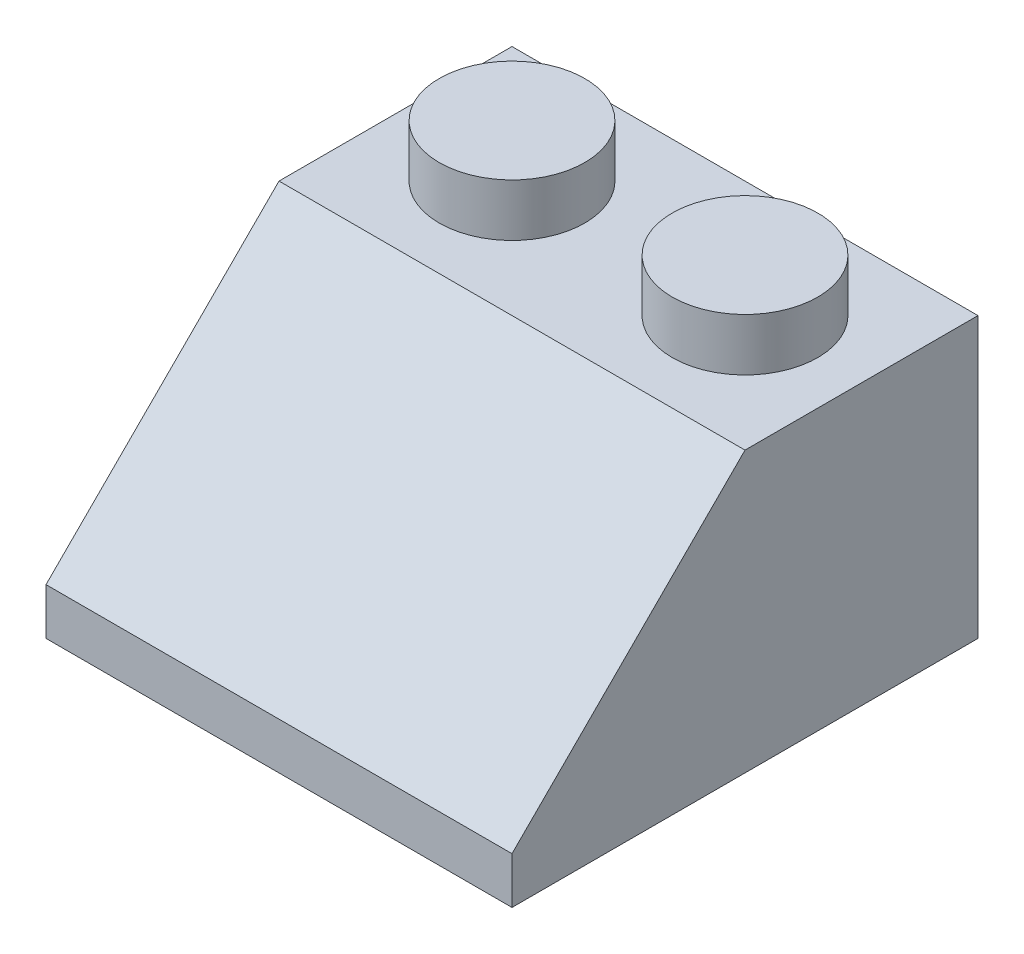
ISO-10303-21;
HEADER;
FILE_DESCRIPTION(('STEP AP214'),'2;1');
FILE_NAME('part.step','',(''),(''),'','','');
FILE_SCHEMA(('AUTOMOTIVE_DESIGN { 1 0 10303 214 1 1 1 1 }'));
ENDSEC;
DATA;
#1=APPLICATION_CONTEXT('core data for automotive mechanical design processes');
#2=APPLICATION_PROTOCOL_DEFINITION('international standard','automotive_design',2000,#1);
#3=PRODUCT_CONTEXT('',#1,'mechanical');
#4=PRODUCT('Part','Part','',(#3));
#5=PRODUCT_RELATED_PRODUCT_CATEGORY('part','',(#4));
#6=PRODUCT_DEFINITION_FORMATION('','',#4);
#7=PRODUCT_DEFINITION_CONTEXT('part definition',#1,'design');
#8=PRODUCT_DEFINITION('design','',#6,#7);
#9=PRODUCT_DEFINITION_SHAPE('','',#8);
#10=(LENGTH_UNIT() NAMED_UNIT(*) SI_UNIT(.MILLI.,.METRE.));
#11=(NAMED_UNIT(*) PLANE_ANGLE_UNIT() SI_UNIT($,.RADIAN.));
#12=(NAMED_UNIT(*) SI_UNIT($,.STERADIAN.) SOLID_ANGLE_UNIT());
#13=UNCERTAINTY_MEASURE_WITH_UNIT(LENGTH_MEASURE(1.E-05),#10,'distance_accuracy_value','');
#14=(GEOMETRIC_REPRESENTATION_CONTEXT(3) GLOBAL_UNCERTAINTY_ASSIGNED_CONTEXT((#13)) GLOBAL_UNIT_ASSIGNED_CONTEXT((#10,
#11,#12)) REPRESENTATION_CONTEXT('',''));
#15=CARTESIAN_POINT('',(0.,0.,0.));
#16=DIRECTION('',(0.,0.,1.));
#17=DIRECTION('',(1.,0.,0.));
#18=AXIS2_PLACEMENT_3D('',#15,#16,#17);
#19=CARTESIAN_POINT('',(-8.,9.6,0.));
#20=DIRECTION('',(0.,1.,0.));
#21=DIRECTION('',(0.,0.,1.));
#22=AXIS2_PLACEMENT_3D('',#19,#20,#21);
#23=PLANE('',#22);
#24=CARTESIAN_POINT('',(-4.,9.6,-12.));
#25=DIRECTION('',(0.,1.,0.));
#26=DIRECTION('',(0.,0.,1.));
#27=AXIS2_PLACEMENT_3D('',#24,#25,#26);
#28=CIRCLE('',#27,2.5);
#29=CARTESIAN_POINT('',(-4.,9.6,-9.50000000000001));
#30=VERTEX_POINT('',#29);
#31=EDGE_CURVE('E390',#30,#30,#28,.T.);
#32=ORIENTED_EDGE('',*,*,#31,.F.);
#33=EDGE_LOOP('',(#32));
#34=FACE_BOUND('',#33,.T.);
#35=DIRECTION('',(0.,0.,1.));
#36=VECTOR('',#35,1.);
#37=CARTESIAN_POINT('',(-8.,9.6,-16.));
#38=LINE('',#37,#36);
#39=CARTESIAN_POINT('',(-8.,9.6,-16.));
#40=VERTEX_POINT('',#39);
#41=CARTESIAN_POINT('',(-8.,9.6,-8.00000000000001));
#42=VERTEX_POINT('',#41);
#43=EDGE_CURVE('E158',#40,#42,#38,.T.);
#44=ORIENTED_EDGE('',*,*,#43,.T.);
#45=DIRECTION('',(1.,0.,0.));
#46=VECTOR('',#45,1.);
#47=CARTESIAN_POINT('',(8.,9.6,-8.00000000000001));
#48=LINE('',#47,#46);
#49=CARTESIAN_POINT('',(8.,9.6,-8.00000000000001));
#50=VERTEX_POINT('',#49);
#51=EDGE_CURVE('E175',#42,#50,#48,.T.);
#52=ORIENTED_EDGE('',*,*,#51,.T.);
#53=DIRECTION('',(0.,0.,-1.));
#54=VECTOR('',#53,1.);
#55=CARTESIAN_POINT('',(8.,9.6,-16.));
#56=LINE('',#55,#54);
#57=CARTESIAN_POINT('',(8.,9.6,-16.));
#58=VERTEX_POINT('',#57);
#59=EDGE_CURVE('E161',#50,#58,#56,.T.);
#60=ORIENTED_EDGE('',*,*,#59,.T.);
#61=DIRECTION('',(-1.,0.,0.));
#62=VECTOR('',#61,1.);
#63=CARTESIAN_POINT('',(-8.,9.6,-16.));
#64=LINE('',#63,#62);
#65=EDGE_CURVE('E163',#58,#40,#64,.T.);
#66=ORIENTED_EDGE('',*,*,#65,.T.);
#67=EDGE_LOOP('',(#44,#52,#60,#66));
#68=FACE_BOUND('',#67,.T.);
#69=CARTESIAN_POINT('',(4.,9.6,-12.));
#70=DIRECTION('',(0.,1.,0.));
#71=DIRECTION('',(0.,0.,1.));
#72=AXIS2_PLACEMENT_3D('',#69,#70,#71);
#73=CIRCLE('',#72,2.5);
#74=CARTESIAN_POINT('',(4.,9.6,-9.50000000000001));
#75=VERTEX_POINT('',#74);
#76=EDGE_CURVE('E391',#75,#75,#73,.T.);
#77=ORIENTED_EDGE('',*,*,#76,.F.);
#78=EDGE_LOOP('',(#77));
#79=FACE_BOUND('',#78,.T.);
#80=ADVANCED_FACE('F29',(#34,#68,#79),#23,.T.);
#81=CARTESIAN_POINT('',(-8.,9.6,-16.));
#82=DIRECTION('',(1.,0.,0.));
#83=DIRECTION('',(0.,0.,-1.));
#84=AXIS2_PLACEMENT_3D('',#81,#82,#83);
#85=PLANE('',#84);
#86=DIRECTION('',(0.,-1.,0.));
#87=VECTOR('',#86,1.);
#88=CARTESIAN_POINT('',(-8.,9.6,0.));
#89=LINE('',#88,#87);
#90=CARTESIAN_POINT('',(-8.,1.59999999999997,0.));
#91=VERTEX_POINT('',#90);
#92=CARTESIAN_POINT('',(-8.,0.,0.));
#93=VERTEX_POINT('',#92);
#94=EDGE_CURVE('E173',#91,#93,#89,.T.);
#95=ORIENTED_EDGE('',*,*,#94,.F.);
#96=DIRECTION('',(0.,0.707106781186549,-0.707106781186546));
#97=VECTOR('',#96,1.);
#98=CARTESIAN_POINT('',(-8.,9.6,-8.00000000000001));
#99=LINE('',#98,#97);
#100=EDGE_CURVE('E11',#91,#42,#99,.T.);
#101=ORIENTED_EDGE('',*,*,#100,.T.);
#102=ORIENTED_EDGE('',*,*,#43,.F.);
#103=DIRECTION('',(0.,-1.,0.));
#104=VECTOR('',#103,1.);
#105=CARTESIAN_POINT('',(-8.,9.6,-16.));
#106=LINE('',#105,#104);
#107=CARTESIAN_POINT('',(-8.,0.,-16.));
#108=VERTEX_POINT('',#107);
#109=EDGE_CURVE('E165',#40,#108,#106,.T.);
#110=ORIENTED_EDGE('',*,*,#109,.T.);
#111=DIRECTION('',(0.,0.,1.));
#112=VECTOR('',#111,1.);
#113=CARTESIAN_POINT('',(-8.,0.,-16.));
#114=LINE('',#113,#112);
#115=EDGE_CURVE('E148',#108,#93,#114,.T.);
#116=ORIENTED_EDGE('',*,*,#115,.T.);
#117=EDGE_LOOP('',(#95,#101,#102,#110,#116));
#118=FACE_BOUND('',#117,.T.);
#119=ADVANCED_FACE('F31',(#118),#85,.F.);
#120=CARTESIAN_POINT('',(-8.,9.6,0.));
#121=DIRECTION('',(0.,0.,-1.));
#122=DIRECTION('',(-1.,0.,0.));
#123=AXIS2_PLACEMENT_3D('',#120,#121,#122);
#124=PLANE('',#123);
#125=DIRECTION('',(0.,-1.,0.));
#126=VECTOR('',#125,1.);
#127=CARTESIAN_POINT('',(8.,9.6,0.));
#128=LINE('',#127,#126);
#129=CARTESIAN_POINT('',(8.,1.59999999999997,0.));
#130=VERTEX_POINT('',#129);
#131=CARTESIAN_POINT('',(8.,0.,0.));
#132=VERTEX_POINT('',#131);
#133=EDGE_CURVE('E171',#130,#132,#128,.T.);
#134=ORIENTED_EDGE('',*,*,#133,.F.);
#135=DIRECTION('',(-1.,0.,0.));
#136=VECTOR('',#135,1.);
#137=CARTESIAN_POINT('',(-8.,1.59999999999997,0.));
#138=LINE('',#137,#136);
#139=EDGE_CURVE('E37',#130,#91,#138,.T.);
#140=ORIENTED_EDGE('',*,*,#139,.T.);
#141=ORIENTED_EDGE('',*,*,#94,.T.);
#142=DIRECTION('',(1.,0.,0.));
#143=VECTOR('',#142,1.);
#144=CARTESIAN_POINT('',(-8.,0.,0.));
#145=LINE('',#144,#143);
#146=EDGE_CURVE('E151',#93,#132,#145,.T.);
#147=ORIENTED_EDGE('',*,*,#146,.T.);
#148=EDGE_LOOP('',(#134,#140,#141,#147));
#149=FACE_BOUND('',#148,.T.);
#150=ADVANCED_FACE('F183',(#149),#124,.F.);
#151=CARTESIAN_POINT('',(8.,9.6,-16.));
#152=DIRECTION('',(-1.,0.,0.));
#153=DIRECTION('',(0.,0.,1.));
#154=AXIS2_PLACEMENT_3D('',#151,#152,#153);
#155=PLANE('',#154);
#156=ORIENTED_EDGE('',*,*,#59,.F.);
#157=DIRECTION('',(0.,-0.707106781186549,0.707106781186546));
#158=VECTOR('',#157,1.);
#159=CARTESIAN_POINT('',(8.,9.6,-8.00000000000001));
#160=LINE('',#159,#158);
#161=EDGE_CURVE('E178',#50,#130,#160,.T.);
#162=ORIENTED_EDGE('',*,*,#161,.T.);
#163=ORIENTED_EDGE('',*,*,#133,.T.);
#164=DIRECTION('',(0.,0.,-1.));
#165=VECTOR('',#164,1.);
#166=CARTESIAN_POINT('',(8.,0.,-16.));
#167=LINE('',#166,#165);
#168=CARTESIAN_POINT('',(8.,0.,-16.));
#169=VERTEX_POINT('',#168);
#170=EDGE_CURVE('E154',#132,#169,#167,.T.);
#171=ORIENTED_EDGE('',*,*,#170,.T.);
#172=DIRECTION('',(0.,-1.,0.));
#173=VECTOR('',#172,1.);
#174=CARTESIAN_POINT('',(8.,9.6,-16.));
#175=LINE('',#174,#173);
#176=EDGE_CURVE('E168',#58,#169,#175,.T.);
#177=ORIENTED_EDGE('',*,*,#176,.F.);
#178=EDGE_LOOP('',(#156,#162,#163,#171,#177));
#179=FACE_BOUND('',#178,.T.);
#180=ADVANCED_FACE('F197',(#179),#155,.F.);
#181=CARTESIAN_POINT('',(-8.,9.6,-16.));
#182=DIRECTION('',(0.,0.,1.));
#183=DIRECTION('',(1.,0.,0.));
#184=AXIS2_PLACEMENT_3D('',#181,#182,#183);
#185=PLANE('',#184);
#186=DIRECTION('',(-1.,0.,0.));
#187=VECTOR('',#186,1.);
#188=CARTESIAN_POINT('',(-8.,0.,-16.));
#189=LINE('',#188,#187);
#190=EDGE_CURVE('E156',#169,#108,#189,.T.);
#191=ORIENTED_EDGE('',*,*,#190,.T.);
#192=ORIENTED_EDGE('',*,*,#109,.F.);
#193=ORIENTED_EDGE('',*,*,#65,.F.);
#194=ORIENTED_EDGE('',*,*,#176,.T.);
#195=EDGE_LOOP('',(#191,#192,#193,#194));
#196=FACE_BOUND('',#195,.T.);
#197=ADVANCED_FACE('F203',(#196),#185,.F.);
#198=CARTESIAN_POINT('',(-8.,0.,0.));
#199=DIRECTION('',(0.,1.,0.));
#200=DIRECTION('',(0.,0.,1.));
#201=AXIS2_PLACEMENT_3D('',#198,#199,#200);
#202=PLANE('',#201);
#203=DIRECTION('',(-1.,0.,0.));
#204=VECTOR('',#203,1.);
#205=CARTESIAN_POINT('',(-8.,0.,-14.8));
#206=LINE('',#205,#204);
#207=CARTESIAN_POINT('',(6.8,0.,-14.8));
#208=VERTEX_POINT('',#207);
#209=CARTESIAN_POINT('',(-6.8,0.,-14.8));
#210=VERTEX_POINT('',#209);
#211=EDGE_CURVE('E141',#208,#210,#206,.T.);
#212=ORIENTED_EDGE('',*,*,#211,.T.);
#213=DIRECTION('',(0.,0.,1.));
#214=VECTOR('',#213,1.);
#215=CARTESIAN_POINT('',(-6.8,0.,-16.));
#216=LINE('',#215,#214);
#217=CARTESIAN_POINT('',(-6.8,0.,-1.2));
#218=VERTEX_POINT('',#217);
#219=EDGE_CURVE('E123',#210,#218,#216,.T.);
#220=ORIENTED_EDGE('',*,*,#219,.T.);
#221=DIRECTION('',(1.,0.,0.));
#222=VECTOR('',#221,1.);
#223=CARTESIAN_POINT('',(-8.,0.,-1.2));
#224=LINE('',#223,#222);
#225=CARTESIAN_POINT('',(6.8,0.,-1.2));
#226=VERTEX_POINT('',#225);
#227=EDGE_CURVE('E140',#218,#226,#224,.T.);
#228=ORIENTED_EDGE('',*,*,#227,.T.);
#229=DIRECTION('',(0.,0.,-1.));
#230=VECTOR('',#229,1.);
#231=CARTESIAN_POINT('',(6.8,0.,-16.));
#232=LINE('',#231,#230);
#233=EDGE_CURVE('E51',#226,#208,#232,.T.);
#234=ORIENTED_EDGE('',*,*,#233,.T.);
#235=EDGE_LOOP('',(#212,#220,#228,#234));
#236=FACE_BOUND('',#235,.T.);
#237=ORIENTED_EDGE('',*,*,#115,.F.);
#238=ORIENTED_EDGE('',*,*,#190,.F.);
#239=ORIENTED_EDGE('',*,*,#170,.F.);
#240=ORIENTED_EDGE('',*,*,#146,.F.);
#241=EDGE_LOOP('',(#237,#238,#239,#240));
#242=FACE_BOUND('',#241,.T.);
#243=ADVANCED_FACE('F205',(#236,#242),#202,.F.);
#244=CARTESIAN_POINT('',(-8.,9.6,-8.00000000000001));
#245=DIRECTION('',(0.,0.707106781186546,0.707106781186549));
#246=DIRECTION('',(0.,-0.707106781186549,0.707106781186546));
#247=AXIS2_PLACEMENT_3D('',#244,#245,#246);
#248=PLANE('',#247);
#249=ORIENTED_EDGE('',*,*,#100,.F.);
#250=ORIENTED_EDGE('',*,*,#139,.F.);
#251=ORIENTED_EDGE('',*,*,#161,.F.);
#252=ORIENTED_EDGE('',*,*,#51,.F.);
#253=EDGE_LOOP('',(#249,#250,#251,#252));
#254=FACE_BOUND('',#253,.T.);
#255=ADVANCED_FACE('F191',(#254),#248,.T.);
#256=CARTESIAN_POINT('',(-6.8,9.6,-16.));
#257=DIRECTION('',(1.,0.,0.));
#258=DIRECTION('',(0.,0.,-1.));
#259=AXIS2_PLACEMENT_3D('',#256,#257,#258);
#260=PLANE('',#259);
#261=DIRECTION('',(0.,-1.,0.));
#262=VECTOR('',#261,1.);
#263=CARTESIAN_POINT('',(-6.8,9.6,-1.2));
#264=LINE('',#263,#262);
#265=CARTESIAN_POINT('',(-6.8,1.10294372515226,-1.2));
#266=VERTEX_POINT('',#265);
#267=EDGE_CURVE('E133',#266,#218,#264,.T.);
#268=ORIENTED_EDGE('',*,*,#267,.T.);
#269=ORIENTED_EDGE('',*,*,#219,.F.);
#270=DIRECTION('',(0.,-1.,0.));
#271=VECTOR('',#270,1.);
#272=CARTESIAN_POINT('',(-6.8,9.6,-14.8));
#273=LINE('',#272,#271);
#274=CARTESIAN_POINT('',(-6.8,8.4,-14.8));
#275=VERTEX_POINT('',#274);
#276=EDGE_CURVE('E414',#275,#210,#273,.T.);
#277=ORIENTED_EDGE('',*,*,#276,.F.);
#278=DIRECTION('',(0.,0.,1.));
#279=VECTOR('',#278,1.);
#280=CARTESIAN_POINT('',(-6.8,8.4,-16.));
#281=LINE('',#280,#279);
#282=CARTESIAN_POINT('',(-6.8,8.4,-8.49705627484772));
#283=VERTEX_POINT('',#282);
#284=EDGE_CURVE('E144',#275,#283,#281,.T.);
#285=ORIENTED_EDGE('',*,*,#284,.T.);
#286=DIRECTION('',(0.,0.707106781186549,-0.707106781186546));
#287=VECTOR('',#286,1.);
#288=CARTESIAN_POINT('',(-6.8,8.75147186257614,-8.84852813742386));
#289=LINE('',#288,#287);
#290=EDGE_CURVE('E127',#266,#283,#289,.T.);
#291=ORIENTED_EDGE('',*,*,#290,.F.);
#292=EDGE_LOOP('',(#268,#269,#277,#285,#291));
#293=FACE_BOUND('',#292,.T.);
#294=ADVANCED_FACE('F213',(#293),#260,.T.);
#295=CARTESIAN_POINT('',(-8.,9.6,-1.2));
#296=DIRECTION('',(0.,0.,-1.));
#297=DIRECTION('',(-1.,0.,0.));
#298=AXIS2_PLACEMENT_3D('',#295,#296,#297);
#299=PLANE('',#298);
#300=DIRECTION('',(0.,-1.,0.));
#301=VECTOR('',#300,1.);
#302=CARTESIAN_POINT('',(6.8,9.6,-1.2));
#303=LINE('',#302,#301);
#304=CARTESIAN_POINT('',(6.8,1.10294372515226,-1.2));
#305=VERTEX_POINT('',#304);
#306=EDGE_CURVE('E410',#305,#226,#303,.T.);
#307=ORIENTED_EDGE('',*,*,#306,.T.);
#308=ORIENTED_EDGE('',*,*,#227,.F.);
#309=ORIENTED_EDGE('',*,*,#267,.F.);
#310=DIRECTION('',(-1.,0.,0.));
#311=VECTOR('',#310,1.);
#312=CARTESIAN_POINT('',(-8.,1.10294372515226,-1.2));
#313=LINE('',#312,#311);
#314=EDGE_CURVE('E131',#305,#266,#313,.T.);
#315=ORIENTED_EDGE('',*,*,#314,.F.);
#316=EDGE_LOOP('',(#307,#308,#309,#315));
#317=FACE_BOUND('',#316,.T.);
#318=ADVANCED_FACE('F258',(#317),#299,.T.);
#319=CARTESIAN_POINT('',(6.8,9.6,-16.));
#320=DIRECTION('',(-1.,0.,0.));
#321=DIRECTION('',(0.,0.,1.));
#322=AXIS2_PLACEMENT_3D('',#319,#320,#321);
#323=PLANE('',#322);
#324=DIRECTION('',(0.,0.,-1.));
#325=VECTOR('',#324,1.);
#326=CARTESIAN_POINT('',(6.8,8.4,-16.));
#327=LINE('',#326,#325);
#328=CARTESIAN_POINT('',(6.8,8.4,-8.49705627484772));
#329=VERTEX_POINT('',#328);
#330=CARTESIAN_POINT('',(6.8,8.4,-14.8));
#331=VERTEX_POINT('',#330);
#332=EDGE_CURVE('E413',#329,#331,#327,.T.);
#333=ORIENTED_EDGE('',*,*,#332,.T.);
#334=DIRECTION('',(0.,-1.,0.));
#335=VECTOR('',#334,1.);
#336=CARTESIAN_POINT('',(6.8,9.6,-14.8));
#337=LINE('',#336,#335);
#338=EDGE_CURVE('E416',#331,#208,#337,.T.);
#339=ORIENTED_EDGE('',*,*,#338,.T.);
#340=ORIENTED_EDGE('',*,*,#233,.F.);
#341=ORIENTED_EDGE('',*,*,#306,.F.);
#342=DIRECTION('',(0.,-0.707106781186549,0.707106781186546));
#343=VECTOR('',#342,1.);
#344=CARTESIAN_POINT('',(6.8,8.75147186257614,-8.84852813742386));
#345=LINE('',#344,#343);
#346=EDGE_CURVE('E129',#329,#305,#345,.T.);
#347=ORIENTED_EDGE('',*,*,#346,.F.);
#348=EDGE_LOOP('',(#333,#339,#340,#341,#347));
#349=FACE_BOUND('',#348,.T.);
#350=ADVANCED_FACE('F268',(#349),#323,.T.);
#351=CARTESIAN_POINT('',(-8.,9.6,-14.8));
#352=DIRECTION('',(0.,0.,1.));
#353=DIRECTION('',(1.,0.,0.));
#354=AXIS2_PLACEMENT_3D('',#351,#352,#353);
#355=PLANE('',#354);
#356=ORIENTED_EDGE('',*,*,#211,.F.);
#357=ORIENTED_EDGE('',*,*,#338,.F.);
#358=DIRECTION('',(-1.,0.,0.));
#359=VECTOR('',#358,1.);
#360=CARTESIAN_POINT('',(-8.,8.4,-14.8));
#361=LINE('',#360,#359);
#362=EDGE_CURVE('E136',#331,#275,#361,.T.);
#363=ORIENTED_EDGE('',*,*,#362,.T.);
#364=ORIENTED_EDGE('',*,*,#276,.T.);
#365=EDGE_LOOP('',(#356,#357,#363,#364));
#366=FACE_BOUND('',#365,.T.);
#367=ADVANCED_FACE('F278',(#366),#355,.T.);
#368=CARTESIAN_POINT('',(-8.,8.4,0.));
#369=DIRECTION('',(0.,1.,0.));
#370=DIRECTION('',(0.,0.,1.));
#371=AXIS2_PLACEMENT_3D('',#368,#369,#370);
#372=PLANE('',#371);
#373=DIRECTION('',(1.,0.,0.));
#374=VECTOR('',#373,1.);
#375=CARTESIAN_POINT('',(-8.,8.4,-8.49705627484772));
#376=LINE('',#375,#374);
#377=CARTESIAN_POINT('',(3.2,8.4,-8.49705627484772));
#378=VERTEX_POINT('',#377);
#379=EDGE_CURVE('E122',#378,#329,#376,.T.);
#380=ORIENTED_EDGE('',*,*,#379,.F.);
#381=CARTESIAN_POINT('',(0.,8.4,-8.49705627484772));
#382=DIRECTION('',(0.,1.,0.));
#383=DIRECTION('',(0.,0.,1.));
#384=AXIS2_PLACEMENT_3D('',#381,#382,#383);
#385=CIRCLE('',#384,3.2);
#386=CARTESIAN_POINT('',(-3.2,8.4,-8.49705627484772));
#387=VERTEX_POINT('',#386);
#388=EDGE_CURVE('E43',#387,#378,#385,.F.);
#389=ORIENTED_EDGE('',*,*,#388,.F.);
#390=EDGE_CURVE('E120',#283,#387,#376,.T.);
#391=ORIENTED_EDGE('',*,*,#390,.F.);
#392=ORIENTED_EDGE('',*,*,#284,.F.);
#393=ORIENTED_EDGE('',*,*,#362,.F.);
#394=ORIENTED_EDGE('',*,*,#332,.F.);
#395=EDGE_LOOP('',(#380,#389,#391,#392,#393,#394));
#396=FACE_BOUND('',#395,.T.);
#397=ADVANCED_FACE('F118',(#396),#372,.F.);
#398=CARTESIAN_POINT('',(-8.,8.75147186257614,-8.84852813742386));
#399=DIRECTION('',(0.,0.707106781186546,0.707106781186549));
#400=DIRECTION('',(0.,-0.707106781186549,0.707106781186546));
#401=AXIS2_PLACEMENT_3D('',#398,#399,#400);
#402=PLANE('',#401);
#403=ORIENTED_EDGE('',*,*,#390,.T.);
#404=CARTESIAN_POINT('',(0.,8.4,-8.49705627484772));
#405=DIRECTION('',(0.,0.707106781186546,0.707106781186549));
#406=DIRECTION('',(0.,-0.707106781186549,0.707106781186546));
#407=AXIS2_PLACEMENT_3D('',#404,#405,#406);
#408=ELLIPSE('',#407,4.52548339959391,3.2);
#409=EDGE_CURVE('E109',#378,#387,#408,.F.);
#410=ORIENTED_EDGE('',*,*,#409,.F.);
#411=ORIENTED_EDGE('',*,*,#379,.T.);
#412=ORIENTED_EDGE('',*,*,#346,.T.);
#413=ORIENTED_EDGE('',*,*,#314,.T.);
#414=ORIENTED_EDGE('',*,*,#290,.T.);
#415=EDGE_LOOP('',(#403,#410,#411,#412,#413,#414));
#416=FACE_BOUND('',#415,.T.);
#417=ADVANCED_FACE('F125',(#416),#402,.F.);
#418=CARTESIAN_POINT('',(0.,0.,-8.49705627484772));
#419=DIRECTION('',(0.,-1.,0.));
#420=DIRECTION('',(0.,0.,-1.));
#421=AXIS2_PLACEMENT_3D('',#418,#419,#420);
#422=PLANE('',#421);
#423=CARTESIAN_POINT('',(0.,0.,-8.49705627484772));
#424=DIRECTION('',(0.,-1.,0.));
#425=DIRECTION('',(0.,0.,-1.));
#426=AXIS2_PLACEMENT_3D('',#423,#424,#425);
#427=CIRCLE('',#426,2.5);
#428=CARTESIAN_POINT('',(0.,0.,-10.9970562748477));
#429=VERTEX_POINT('',#428);
#430=EDGE_CURVE('E401',#429,#429,#427,.T.);
#431=ORIENTED_EDGE('',*,*,#430,.F.);
#432=EDGE_LOOP('',(#431));
#433=FACE_BOUND('',#432,.T.);
#434=CARTESIAN_POINT('',(0.,0.,-8.49705627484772));
#435=DIRECTION('',(0.,-1.,0.));
#436=DIRECTION('',(0.,0.,-1.));
#437=AXIS2_PLACEMENT_3D('',#434,#435,#436);
#438=CIRCLE('',#437,3.2);
#439=CARTESIAN_POINT('',(0.,0.,-11.6970562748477));
#440=VERTEX_POINT('',#439);
#441=EDGE_CURVE('E114',#440,#440,#438,.T.);
#442=ORIENTED_EDGE('',*,*,#441,.T.);
#443=EDGE_LOOP('',(#442));
#444=FACE_BOUND('',#443,.T.);
#445=ADVANCED_FACE('F304',(#433,#444),#422,.T.);
#446=CARTESIAN_POINT('',(0.,9.601,-8.49705627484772));
#447=DIRECTION('',(0.,-1.,0.));
#448=DIRECTION('',(0.,0.,-1.));
#449=AXIS2_PLACEMENT_3D('',#446,#447,#448);
#450=CYLINDRICAL_SURFACE('',#449,3.2);
#451=ORIENTED_EDGE('',*,*,#441,.F.);
#452=EDGE_LOOP('',(#451));
#453=FACE_BOUND('',#452,.T.);
#454=ORIENTED_EDGE('',*,*,#409,.T.);
#455=ORIENTED_EDGE('',*,*,#388,.T.);
#456=EDGE_LOOP('',(#454,#455));
#457=FACE_BOUND('',#456,.T.);
#458=ADVANCED_FACE('F110',(#453,#457),#450,.T.);
#459=CARTESIAN_POINT('',(0.,6.60000000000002,-8.49705627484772));
#460=DIRECTION('',(0.,-1.,0.));
#461=DIRECTION('',(0.,0.,-1.));
#462=AXIS2_PLACEMENT_3D('',#459,#460,#461);
#463=CYLINDRICAL_SURFACE('',#462,2.5);
#464=CARTESIAN_POINT('',(0.,6.60000000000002,-8.49705627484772));
#465=DIRECTION('',(0.,-1.,0.));
#466=DIRECTION('',(0.,0.,-1.));
#467=AXIS2_PLACEMENT_3D('',#464,#465,#466);
#468=CIRCLE('',#467,2.5);
#469=CARTESIAN_POINT('',(0.,6.60000000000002,-10.9970562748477));
#470=VERTEX_POINT('',#469);
#471=EDGE_CURVE('E404',#470,#470,#468,.T.);
#472=ORIENTED_EDGE('',*,*,#471,.F.);
#473=EDGE_LOOP('',(#472));
#474=FACE_BOUND('',#473,.T.);
#475=ORIENTED_EDGE('',*,*,#430,.T.);
#476=EDGE_LOOP('',(#475));
#477=FACE_BOUND('',#476,.T.);
#478=ADVANCED_FACE('F322',(#474,#477),#463,.F.);
#479=CARTESIAN_POINT('',(0.,6.60000000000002,-8.49705627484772));
#480=DIRECTION('',(0.,-1.,0.));
#481=DIRECTION('',(0.,0.,-1.));
#482=AXIS2_PLACEMENT_3D('',#479,#480,#481);
#483=PLANE('',#482);
#484=ORIENTED_EDGE('',*,*,#471,.T.);
#485=EDGE_LOOP('',(#484));
#486=FACE_BOUND('',#485,.T.);
#487=ADVANCED_FACE('F332',(#486),#483,.T.);
#488=CARTESIAN_POINT('',(-4.,11.4,-12.));
#489=DIRECTION('',(0.,-1.,0.));
#490=DIRECTION('',(0.,0.,-1.));
#491=AXIS2_PLACEMENT_3D('',#488,#489,#490);
#492=CYLINDRICAL_SURFACE('',#491,2.5);
#493=CARTESIAN_POINT('',(-4.,11.4,-12.));
#494=DIRECTION('',(0.,1.,0.));
#495=DIRECTION('',(0.,0.,1.));
#496=AXIS2_PLACEMENT_3D('',#493,#494,#495);
#497=CIRCLE('',#496,2.5);
#498=CARTESIAN_POINT('',(-4.,11.4,-9.50000000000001));
#499=VERTEX_POINT('',#498);
#500=EDGE_CURVE('E394',#499,#499,#497,.T.);
#501=ORIENTED_EDGE('',*,*,#500,.F.);
#502=EDGE_LOOP('',(#501));
#503=FACE_BOUND('',#502,.T.);
#504=ORIENTED_EDGE('',*,*,#31,.T.);
#505=EDGE_LOOP('',(#504));
#506=FACE_BOUND('',#505,.T.);
#507=ADVANCED_FACE('F342',(#503,#506),#492,.T.);
#508=CARTESIAN_POINT('',(-4.,11.4,-12.));
#509=DIRECTION('',(0.,1.,0.));
#510=DIRECTION('',(0.,0.,1.));
#511=AXIS2_PLACEMENT_3D('',#508,#509,#510);
#512=PLANE('',#511);
#513=ORIENTED_EDGE('',*,*,#500,.T.);
#514=EDGE_LOOP('',(#513));
#515=FACE_BOUND('',#514,.T.);
#516=ADVANCED_FACE('F352',(#515),#512,.T.);
#517=CARTESIAN_POINT('',(4.,11.4,-12.));
#518=DIRECTION('',(0.,-1.,0.));
#519=DIRECTION('',(0.,0.,-1.));
#520=AXIS2_PLACEMENT_3D('',#517,#518,#519);
#521=CYLINDRICAL_SURFACE('',#520,2.5);
#522=CARTESIAN_POINT('',(4.,11.4,-12.));
#523=DIRECTION('',(0.,1.,0.));
#524=DIRECTION('',(0.,0.,1.));
#525=AXIS2_PLACEMENT_3D('',#522,#523,#524);
#526=CIRCLE('',#525,2.5);
#527=CARTESIAN_POINT('',(4.,11.4,-9.50000000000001));
#528=VERTEX_POINT('',#527);
#529=EDGE_CURVE('E389',#528,#528,#526,.T.);
#530=ORIENTED_EDGE('',*,*,#529,.F.);
#531=EDGE_LOOP('',(#530));
#532=FACE_BOUND('',#531,.T.);
#533=ORIENTED_EDGE('',*,*,#76,.T.);
#534=EDGE_LOOP('',(#533));
#535=FACE_BOUND('',#534,.T.);
#536=ADVANCED_FACE('F362',(#532,#535),#521,.T.);
#537=CARTESIAN_POINT('',(4.,11.4,-12.));
#538=DIRECTION('',(0.,1.,0.));
#539=DIRECTION('',(0.,0.,1.));
#540=AXIS2_PLACEMENT_3D('',#537,#538,#539);
#541=PLANE('',#540);
#542=ORIENTED_EDGE('',*,*,#529,.T.);
#543=EDGE_LOOP('',(#542));
#544=FACE_BOUND('',#543,.T.);
#545=ADVANCED_FACE('F365',(#544),#541,.T.);
#546=CLOSED_SHELL('',(#80,#119,#150,#180,#197,#243,#255,#294,#318,#350,#367,#397,#417,#445,#458,
#478,#487,#507,#516,#536,#545));
#547=MANIFOLD_SOLID_BREP('B2',#546);
#548=ADVANCED_BREP_SHAPE_REPRESENTATION('',(#18,#547),#14);
#549=SHAPE_DEFINITION_REPRESENTATION(#9,#548);
ENDSEC;
END-ISO-10303-21;
